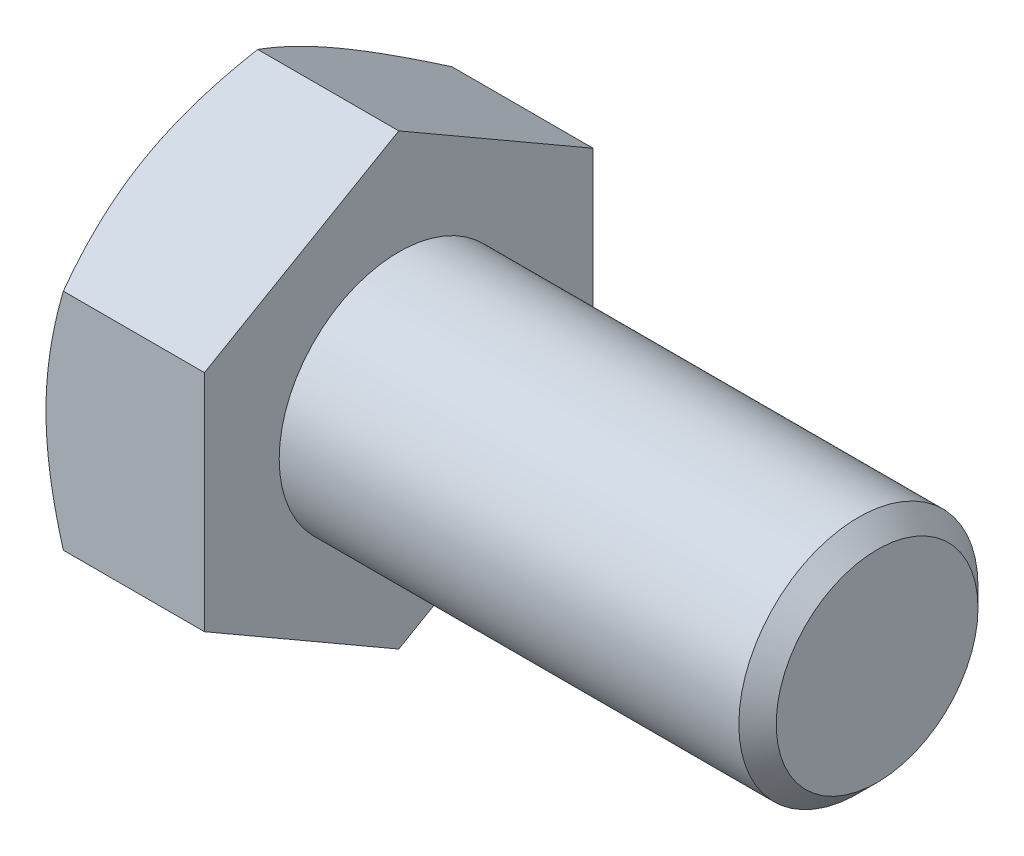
ISO-10303-21;
HEADER;
FILE_DESCRIPTION(('STEP AP214'),'2;1');
FILE_NAME('part.step','',(''),(''),'','','');
FILE_SCHEMA(('AUTOMOTIVE_DESIGN { 1 0 10303 214 1 1 1 1 }'));
ENDSEC;
DATA;
#1=APPLICATION_CONTEXT('core data for automotive mechanical design processes');
#2=APPLICATION_PROTOCOL_DEFINITION('international standard','automotive_design',2000,#1);
#3=PRODUCT_CONTEXT('',#1,'mechanical');
#4=PRODUCT('Part','Part','',(#3));
#5=PRODUCT_RELATED_PRODUCT_CATEGORY('part','',(#4));
#6=PRODUCT_DEFINITION_FORMATION('','',#4);
#7=PRODUCT_DEFINITION_CONTEXT('part definition',#1,'design');
#8=PRODUCT_DEFINITION('design','',#6,#7);
#9=PRODUCT_DEFINITION_SHAPE('','',#8);
#10=(LENGTH_UNIT() NAMED_UNIT(*) SI_UNIT(.MILLI.,.METRE.));
#11=(NAMED_UNIT(*) PLANE_ANGLE_UNIT() SI_UNIT($,.RADIAN.));
#12=(NAMED_UNIT(*) SI_UNIT($,.STERADIAN.) SOLID_ANGLE_UNIT());
#13=UNCERTAINTY_MEASURE_WITH_UNIT(LENGTH_MEASURE(1.E-05),#10,'distance_accuracy_value','');
#14=(GEOMETRIC_REPRESENTATION_CONTEXT(3) GLOBAL_UNCERTAINTY_ASSIGNED_CONTEXT((#13)) GLOBAL_UNIT_ASSIGNED_CONTEXT((#10,
#11,#12)) REPRESENTATION_CONTEXT('',''));
#15=CARTESIAN_POINT('',(0.,0.,0.));
#16=DIRECTION('',(0.,0.,1.));
#17=DIRECTION('',(1.,0.,0.));
#18=AXIS2_PLACEMENT_3D('',#15,#16,#17);
#19=CARTESIAN_POINT('',(16.,0.,0.));
#20=DIRECTION('',(-1.,0.,0.));
#21=DIRECTION('',(0.,0.,1.));
#22=AXIS2_PLACEMENT_3D('',#19,#20,#21);
#23=CYLINDRICAL_SURFACE('',#22,4.);
#24=CARTESIAN_POINT('',(15.375,0.,0.));
#25=DIRECTION('',(1.,0.,0.));
#26=DIRECTION('',(0.,0.,-1.));
#27=AXIS2_PLACEMENT_3D('',#24,#25,#26);
#28=CIRCLE('',#27,4.);
#29=CARTESIAN_POINT('',(15.375,0.,-4.));
#30=VERTEX_POINT('',#29);
#31=EDGE_CURVE('E11',#30,#30,#28,.F.);
#32=ORIENTED_EDGE('',*,*,#31,.T.);
#33=EDGE_LOOP('',(#32));
#34=FACE_BOUND('',#33,.T.);
#35=CARTESIAN_POINT('',(0.,0.,0.));
#36=DIRECTION('',(-1.,0.,0.));
#37=DIRECTION('',(0.,0.,1.));
#38=AXIS2_PLACEMENT_3D('',#35,#36,#37);
#39=CIRCLE('',#38,4.);
#40=CARTESIAN_POINT('',(0.,0.,4.));
#41=VERTEX_POINT('',#40);
#42=EDGE_CURVE('E204',#41,#41,#39,.T.);
#43=ORIENTED_EDGE('',*,*,#42,.F.);
#44=EDGE_LOOP('',(#43));
#45=FACE_BOUND('',#44,.T.);
#46=ADVANCED_FACE('F30',(#34,#45),#23,.T.);
#47=CARTESIAN_POINT('',(16.,0.,0.));
#48=DIRECTION('',(1.,0.,0.));
#49=DIRECTION('',(0.,0.,-1.));
#50=AXIS2_PLACEMENT_3D('',#47,#48,#49);
#51=PLANE('',#50);
#52=CARTESIAN_POINT('',(16.,0.,0.));
#53=DIRECTION('',(1.,0.,0.));
#54=DIRECTION('',(0.,0.,-1.));
#55=AXIS2_PLACEMENT_3D('',#52,#53,#54);
#56=CIRCLE('',#55,3.37499999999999);
#57=CARTESIAN_POINT('',(16.,0.,-3.37499999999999));
#58=VERTEX_POINT('',#57);
#59=EDGE_CURVE('E37',#58,#58,#56,.T.);
#60=ORIENTED_EDGE('',*,*,#59,.T.);
#61=EDGE_LOOP('',(#60));
#62=FACE_BOUND('',#61,.T.);
#63=ADVANCED_FACE('F190',(#62),#51,.T.);
#64=CARTESIAN_POINT('',(0.,-7.50555349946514,0.));
#65=DIRECTION('',(-1.,0.,0.));
#66=DIRECTION('',(0.,0.,1.));
#67=AXIS2_PLACEMENT_3D('',#64,#65,#66);
#68=PLANE('',#67);
#69=DIRECTION('',(0.,0.5,0.866025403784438));
#70=VECTOR('',#69,1.);
#71=CARTESIAN_POINT('',(0.,-7.50555349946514,0.));
#72=LINE('',#71,#70);
#73=CARTESIAN_POINT('',(0.,-7.50555349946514,0.));
#74=VERTEX_POINT('',#73);
#75=CARTESIAN_POINT('',(0.,-3.75277674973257,6.5));
#76=VERTEX_POINT('',#75);
#77=EDGE_CURVE('E231',#74,#76,#72,.T.);
#78=ORIENTED_EDGE('',*,*,#77,.F.);
#79=DIRECTION('',(0.,0.5,-0.866025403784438));
#80=VECTOR('',#79,1.);
#81=CARTESIAN_POINT('',(0.,-7.50555349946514,0.));
#82=LINE('',#81,#80);
#83=CARTESIAN_POINT('',(0.,-3.75277674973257,-6.5));
#84=VERTEX_POINT('',#83);
#85=EDGE_CURVE('E218',#74,#84,#82,.T.);
#86=ORIENTED_EDGE('',*,*,#85,.T.);
#87=DIRECTION('',(0.,1.,0.));
#88=VECTOR('',#87,1.);
#89=CARTESIAN_POINT('',(0.,-3.75277674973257,-6.5));
#90=LINE('',#89,#88);
#91=CARTESIAN_POINT('',(0.,3.75277674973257,-6.5));
#92=VERTEX_POINT('',#91);
#93=EDGE_CURVE('E221',#84,#92,#90,.T.);
#94=ORIENTED_EDGE('',*,*,#93,.T.);
#95=DIRECTION('',(0.,0.5,0.866025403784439));
#96=VECTOR('',#95,1.);
#97=CARTESIAN_POINT('',(0.,3.75277674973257,-6.5));
#98=LINE('',#97,#96);
#99=CARTESIAN_POINT('',(0.,7.50555349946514,0.));
#100=VERTEX_POINT('',#99);
#101=EDGE_CURVE('E224',#92,#100,#98,.T.);
#102=ORIENTED_EDGE('',*,*,#101,.T.);
#103=DIRECTION('',(0.,0.5,-0.866025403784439));
#104=VECTOR('',#103,1.);
#105=CARTESIAN_POINT('',(0.,3.75277674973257,6.5));
#106=LINE('',#105,#104);
#107=CARTESIAN_POINT('',(0.,3.75277674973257,6.5));
#108=VERTEX_POINT('',#107);
#109=EDGE_CURVE('E227',#108,#100,#106,.T.);
#110=ORIENTED_EDGE('',*,*,#109,.F.);
#111=DIRECTION('',(0.,1.,0.));
#112=VECTOR('',#111,1.);
#113=CARTESIAN_POINT('',(0.,-3.75277674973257,6.5));
#114=LINE('',#113,#112);
#115=EDGE_CURVE('E229',#76,#108,#114,.T.);
#116=ORIENTED_EDGE('',*,*,#115,.F.);
#117=EDGE_LOOP('',(#78,#86,#94,#102,#110,#116));
#118=FACE_BOUND('',#117,.T.);
#119=ORIENTED_EDGE('',*,*,#42,.T.);
#120=EDGE_LOOP('',(#119));
#121=FACE_BOUND('',#120,.T.);
#122=ADVANCED_FACE('F161',(#118,#121),#68,.F.);
#123=CARTESIAN_POINT('',(-5.3,-7.50555349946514,0.));
#124=DIRECTION('',(0.,0.866025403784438,-0.5));
#125=DIRECTION('',(0.,0.5,0.866025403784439));
#126=AXIS2_PLACEMENT_3D('',#123,#124,#125);
#127=PLANE('',#126);
#128=CARTESIAN_POINT('',(-4.71937674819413,-7.50566896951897,-0.000200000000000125));
#129=CARTESIAN_POINT('',(-4.76699557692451,-7.4231786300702,0.142677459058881));
#130=CARTESIAN_POINT('',(-4.81245329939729,-7.34038072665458,0.286087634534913));
#131=CARTESIAN_POINT('',(-4.89845131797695,-7.17411251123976,0.574072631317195));
#132=CARTESIAN_POINT('',(-4.93898949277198,-7.09064192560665,0.718647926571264));
#133=CARTESIAN_POINT('',(-5.05242899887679,-6.83889369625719,1.15468865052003));
#134=CARTESIAN_POINT('',(-5.11695219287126,-6.66962231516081,1.44787528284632));
#135=CARTESIAN_POINT('',(-5.19261341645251,-6.41631077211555,1.88662374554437));
#136=CARTESIAN_POINT('',(-5.21416714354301,-6.33302748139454,2.03087463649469));
#137=CARTESIAN_POINT('',(-5.25030968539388,-6.16608458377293,2.32002821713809));
#138=CARTESIAN_POINT('',(-5.26489911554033,-6.08242501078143,2.46493084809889));
#139=CARTESIAN_POINT('',(-5.28674124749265,-5.91496056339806,2.75498777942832));
#140=CARTESIAN_POINT('',(-5.29400227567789,-5.8311559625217,2.90014160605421));
#141=CARTESIAN_POINT('',(-5.30103969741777,-5.66347396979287,3.19057533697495));
#142=CARTESIAN_POINT('',(-5.3008163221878,-5.5795965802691,3.33585523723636));
#143=CARTESIAN_POINT('',(-5.28991654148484,-5.34979921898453,3.73387594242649));
#144=CARTESIAN_POINT('',(-5.27161818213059,-5.20395446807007,3.98648646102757));
#145=CARTESIAN_POINT('',(-5.21359365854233,-4.91323365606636,4.49002967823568));
#146=CARTESIAN_POINT('',(-5.17384766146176,-4.76835861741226,4.74096060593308));
#147=CARTESIAN_POINT('',(-5.07449409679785,-4.47705272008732,5.24551722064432));
#148=CARTESIAN_POINT('',(-5.01446557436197,-4.33065861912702,5.49907924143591));
#149=CARTESIAN_POINT('',(-4.87822500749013,-4.04005357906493,6.00242193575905));
#150=CARTESIAN_POINT('',(-4.80204496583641,-3.89583891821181,6.25220905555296));
#151=CARTESIAN_POINT('',(-4.71937674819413,-3.75266127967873,6.5002));
#152=B_SPLINE_CURVE_WITH_KNOTS('',3,(#128,#129,#130,#131,#132,#133,#134,#135,#136,#137,#138,
#139,#140,#141,#142,#143,#144,#145,#146,#147,#148,#149,#150,#151),.UNSPECIFIED.,.F.,.F.,(4,2,2,
2,2,2,2,2,2,2,2,4),(0.,0.515105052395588,1.03043143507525,2.06322554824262,2.56697389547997,
3.07067772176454,3.57380860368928,4.0769239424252,4.9527935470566,5.82947446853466,
6.72559912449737,7.61996451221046),.UNSPECIFIED.);
#153=CARTESIAN_POINT('',(-4.71944341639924,-7.50555349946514,0.));
#154=VERTEX_POINT('',#153);
#155=CARTESIAN_POINT('',(-5.3,-5.62916512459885,3.25));
#156=VERTEX_POINT('',#155);
#157=EDGE_CURVE('E178',#154,#156,#152,.T.);
#158=ORIENTED_EDGE('',*,*,#157,.F.);
#159=DIRECTION('',(1.,0.,0.));
#160=VECTOR('',#159,1.);
#161=CARTESIAN_POINT('',(-5.3,-7.50555349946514,0.));
#162=LINE('',#161,#160);
#163=EDGE_CURVE('E216',#154,#74,#162,.T.);
#164=ORIENTED_EDGE('',*,*,#163,.T.);
#165=ORIENTED_EDGE('',*,*,#77,.T.);
#166=DIRECTION('',(1.,0.,0.));
#167=VECTOR('',#166,1.);
#168=CARTESIAN_POINT('',(-5.3,-3.75277674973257,6.5));
#169=LINE('',#168,#167);
#170=CARTESIAN_POINT('',(-4.71944341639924,-3.75277674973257,6.5));
#171=VERTEX_POINT('',#170);
#172=EDGE_CURVE('E207',#171,#76,#169,.T.);
#173=ORIENTED_EDGE('',*,*,#172,.F.);
#174=EDGE_CURVE('E132',#156,#171,#152,.T.);
#175=ORIENTED_EDGE('',*,*,#174,.F.);
#176=EDGE_LOOP('',(#158,#164,#165,#173,#175));
#177=FACE_BOUND('',#176,.T.);
#178=ADVANCED_FACE('F184',(#177),#127,.F.);
#179=CARTESIAN_POINT('',(-5.3,-3.75277674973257,6.5));
#180=DIRECTION('',(0.,0.,-1.));
#181=DIRECTION('',(-1.,0.,0.));
#182=AXIS2_PLACEMENT_3D('',#179,#180,#181);
#183=PLANE('',#182);
#184=CARTESIAN_POINT('',(-2.0488375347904,-10.2428264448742,6.5));
#185=CARTESIAN_POINT('',(-2.18789595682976,-9.95749123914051,6.5));
#186=CARTESIAN_POINT('',(-2.32566707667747,-9.67151814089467,6.5));
#187=CARTESIAN_POINT('',(-2.59791370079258,-9.09795746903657,6.5));
#188=CARTESIAN_POINT('',(-2.73238871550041,-8.81036966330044,6.5));
#189=CARTESIAN_POINT('',(-2.99796413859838,-8.23183597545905,6.5));
#190=CARTESIAN_POINT('',(-3.12904355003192,-7.94088042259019,6.5));
#191=CARTESIAN_POINT('',(-3.38604980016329,-7.35671087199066,6.5));
#192=CARTESIAN_POINT('',(-3.51197687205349,-7.06349697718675,6.5));
#193=CARTESIAN_POINT('',(-3.76148583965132,-6.4643492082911,6.5));
#194=CARTESIAN_POINT('',(-3.88484316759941,-6.15832132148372,6.5));
#195=CARTESIAN_POINT('',(-4.122608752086,-5.54274557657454,6.5));
#196=CARTESIAN_POINT('',(-4.23701602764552,-5.23319733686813,6.5));
#197=CARTESIAN_POINT('',(-4.45399730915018,-4.61061796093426,6.5));
#198=CARTESIAN_POINT('',(-4.55659391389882,-4.29759477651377,6.5));
#199=CARTESIAN_POINT('',(-4.7467687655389,-3.66705774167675,6.5));
#200=CARTESIAN_POINT('',(-4.83435157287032,-3.34954528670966,6.5));
#201=CARTESIAN_POINT('',(-4.98994277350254,-2.7116231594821,6.5));
#202=CARTESIAN_POINT('',(-5.05806094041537,-2.39124068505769,6.5));
#203=CARTESIAN_POINT('',(-5.17096432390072,-1.74628166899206,6.5));
#204=CARTESIAN_POINT('',(-5.21575208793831,-1.42170558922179,6.5));
#205=CARTESIAN_POINT('',(-5.26247031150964,-0.935153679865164,6.5));
#206=CARTESIAN_POINT('',(-5.27461755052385,-0.774120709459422,6.5));
#207=CARTESIAN_POINT('',(-5.29209027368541,-0.451677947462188,6.5));
#208=CARTESIAN_POINT('',(-5.29741587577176,-0.290268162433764,6.5));
#209=CARTESIAN_POINT('',(-5.30111032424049,0.0326315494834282,6.5));
#210=CARTESIAN_POINT('',(-5.29947913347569,0.194121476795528,6.5));
#211=CARTESIAN_POINT('',(-5.28930353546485,0.516885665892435,6.5));
#212=CARTESIAN_POINT('',(-5.2807588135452,0.678159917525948,6.5));
#213=CARTESIAN_POINT('',(-5.2524625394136,1.06087214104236,6.5));
#214=CARTESIAN_POINT('',(-5.22970222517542,1.28209274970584,6.5));
#215=CARTESIAN_POINT('',(-5.17237790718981,1.72298724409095,6.5));
#216=CARTESIAN_POINT('',(-5.13781243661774,1.94266093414,6.5));
#217=CARTESIAN_POINT('',(-5.01823337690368,2.59905068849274,6.5));
#218=CARTESIAN_POINT('',(-4.91735524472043,3.03292018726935,6.5));
#219=CARTESIAN_POINT('',(-4.74117763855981,3.68203059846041,6.5));
#220=CARTESIAN_POINT('',(-4.67743243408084,3.90060192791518,6.5));
#221=CARTESIAN_POINT('',(-4.54301317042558,4.33562456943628,6.5));
#222=CARTESIAN_POINT('',(-4.47233905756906,4.55207586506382,6.5));
#223=CARTESIAN_POINT('',(-4.32522134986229,4.9829231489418,6.5));
#224=CARTESIAN_POINT('',(-4.24877936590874,5.19731969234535,6.5));
#225=CARTESIAN_POINT('',(-4.09105605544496,5.62431367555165,6.5));
#226=CARTESIAN_POINT('',(-4.00977484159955,5.83691115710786,6.5));
#227=CARTESIAN_POINT('',(-3.78396124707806,6.41107024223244,6.5));
#228=CARTESIAN_POINT('',(-3.63553740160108,6.7710999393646,6.5));
#229=CARTESIAN_POINT('',(-3.3299136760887,7.4874289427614,6.5));
#230=CARTESIAN_POINT('',(-3.17271280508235,7.84372782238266,6.5));
#231=CARTESIAN_POINT('',(-2.8516207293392,8.55345570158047,6.5));
#232=CARTESIAN_POINT('',(-2.68772693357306,8.90688352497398,6.5));
#233=CARTESIAN_POINT('',(-2.35485675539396,9.61131133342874,6.5));
#234=CARTESIAN_POINT('',(-2.18588058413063,9.96231141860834,6.5));
#235=CARTESIAN_POINT('',(-1.84367823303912,10.662937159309,6.5));
#236=CARTESIAN_POINT('',(-1.67044558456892,11.012559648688,6.5));
#237=CARTESIAN_POINT('',(-1.32082260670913,11.7102232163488,6.5));
#238=CARTESIAN_POINT('',(-1.14443225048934,12.0582642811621,6.5));
#239=CARTESIAN_POINT('',(-0.78915631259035,12.7529700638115,6.5));
#240=CARTESIAN_POINT('',(-0.610271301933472,13.099635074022,6.5));
#241=CARTESIAN_POINT('',(-0.250435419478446,13.7918918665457,6.5));
#242=CARTESIAN_POINT('',(-0.0694845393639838,14.1374836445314,6.5));
#243=CARTESIAN_POINT('',(0.437179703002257,15.099399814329,6.5));
#244=CARTESIAN_POINT('',(0.7647482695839,15.7147468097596,6.5));
#245=CARTESIAN_POINT('',(1.4238123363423,16.9433793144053,6.5));
#246=CARTESIAN_POINT('',(1.75530808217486,17.5566646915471,6.5));
#247=CARTESIAN_POINT('',(2.42008717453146,18.779571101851,6.5));
#248=CARTESIAN_POINT('',(2.75336064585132,19.3891975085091,6.5));
#249=CARTESIAN_POINT('',(3.4221398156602,20.6071616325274,6.5));
#250=CARTESIAN_POINT('',(3.75764533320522,21.2154994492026,6.5));
#251=CARTESIAN_POINT('',(4.0939612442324,21.8233856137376,6.5));
#252=B_SPLINE_CURVE_WITH_KNOTS('',3,(#184,#185,#186,#187,#188,#189,#190,#191,#192,#193,#194,
#195,#196,#197,#198,#199,#200,#201,#202,#203,#204,#205,#206,#207,#208,#209,#210,#211,#212,#213,
#214,#215,#216,#217,#218,#219,#220,#221,#222,#223,#224,#225,#226,#227,#228,#229,#230,#231,#232,
#233,#234,#235,#236,#237,#238,#239,#240,#241,#242,#243,#244,#245,#246,#247,#248,#249,#250,#251),
.UNSPECIFIED.,.F.,.F.,(4,2,2,2,2,2,2,2,2,2,2,2,2,2,2,2,2,2,2,2,2,2,2,2,2,2,2,2,2,2,2,2,2,4),(0.,
0.952261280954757,1.90466315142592,2.86198011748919,3.81925370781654,4.80900961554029,
5.79887385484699,6.78681142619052,7.77444837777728,8.75640022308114,9.73824482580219,
10.2225937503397,10.7069343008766,11.1912774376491,11.6756426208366,12.3424346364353,
13.0093095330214,14.3437044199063,15.0266742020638,15.7096492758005,16.3924343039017,
17.0752034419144,18.2433007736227,19.4115302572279,20.580216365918,21.7488539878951,
22.9193933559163,24.0899426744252,25.2602283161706,26.4305186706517,28.5218066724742,
30.6132261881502,32.6975528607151,34.7817125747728),.UNSPECIFIED.);
#253=CARTESIAN_POINT('',(-5.3,0.,6.5));
#254=VERTEX_POINT('',#253);
#255=EDGE_CURVE('E233',#171,#254,#252,.T.);
#256=ORIENTED_EDGE('',*,*,#255,.F.);
#257=ORIENTED_EDGE('',*,*,#172,.T.);
#258=ORIENTED_EDGE('',*,*,#115,.T.);
#259=DIRECTION('',(1.,0.,0.));
#260=VECTOR('',#259,1.);
#261=CARTESIAN_POINT('',(-5.3,3.75277674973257,6.5));
#262=LINE('',#261,#260);
#263=CARTESIAN_POINT('',(-4.71944341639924,3.75277674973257,6.5));
#264=VERTEX_POINT('',#263);
#265=EDGE_CURVE('E209',#264,#108,#262,.T.);
#266=ORIENTED_EDGE('',*,*,#265,.F.);
#267=EDGE_CURVE('E103',#254,#264,#252,.T.);
#268=ORIENTED_EDGE('',*,*,#267,.F.);
#269=EDGE_LOOP('',(#256,#257,#258,#266,#268));
#270=FACE_BOUND('',#269,.T.);
#271=ADVANCED_FACE('F187',(#270),#183,.F.);
#272=CARTESIAN_POINT('',(-5.3,3.75277674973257,6.5));
#273=DIRECTION('',(0.,-0.866025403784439,-0.5));
#274=DIRECTION('',(0.,0.5,-0.866025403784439));
#275=AXIS2_PLACEMENT_3D('',#272,#273,#274);
#276=PLANE('',#275);
#277=CARTESIAN_POINT('',(-4.71937674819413,3.75266127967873,6.5002));
#278=CARTESIAN_POINT('',(-4.76699557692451,3.83515161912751,6.35732254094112));
#279=CARTESIAN_POINT('',(-4.81245329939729,3.91794952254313,6.21391236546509));
#280=CARTESIAN_POINT('',(-4.89845131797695,4.08421773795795,5.9259273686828));
#281=CARTESIAN_POINT('',(-4.93898949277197,4.16768832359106,5.78135207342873));
#282=CARTESIAN_POINT('',(-5.05242899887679,4.41943655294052,5.34531134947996));
#283=CARTESIAN_POINT('',(-5.11695219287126,4.5887079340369,5.05212471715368));
#284=CARTESIAN_POINT('',(-5.19261341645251,4.84201947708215,4.61337625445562));
#285=CARTESIAN_POINT('',(-5.21416714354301,4.92530276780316,4.46912536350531));
#286=CARTESIAN_POINT('',(-5.25030968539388,5.09224566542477,4.17997178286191));
#287=CARTESIAN_POINT('',(-5.26489911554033,5.17590523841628,4.03506915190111));
#288=CARTESIAN_POINT('',(-5.28674124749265,5.34336968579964,3.74501222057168));
#289=CARTESIAN_POINT('',(-5.29400227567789,5.427174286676,3.59985839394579));
#290=CARTESIAN_POINT('',(-5.30103969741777,5.59485627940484,3.30942466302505));
#291=CARTESIAN_POINT('',(-5.30081632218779,5.6787336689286,3.16414476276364));
#292=CARTESIAN_POINT('',(-5.28991654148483,5.90853103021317,2.7661240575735));
#293=CARTESIAN_POINT('',(-5.27161818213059,6.05437578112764,2.51351353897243));
#294=CARTESIAN_POINT('',(-5.21359365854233,6.34509659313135,2.00997032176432));
#295=CARTESIAN_POINT('',(-5.17384766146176,6.48997163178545,1.75903939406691));
#296=CARTESIAN_POINT('',(-5.07449409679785,6.78127752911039,1.25448277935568));
#297=CARTESIAN_POINT('',(-5.01446557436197,6.92767163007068,1.00092075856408));
#298=CARTESIAN_POINT('',(-4.87822500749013,7.21827667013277,0.497578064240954));
#299=CARTESIAN_POINT('',(-4.80204496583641,7.36249133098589,0.247790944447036));
#300=CARTESIAN_POINT('',(-4.71937674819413,7.50566896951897,-0.000199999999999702));
#301=B_SPLINE_CURVE_WITH_KNOTS('',3,(#277,#278,#279,#280,#281,#282,#283,#284,#285,#286,#287,
#288,#289,#290,#291,#292,#293,#294,#295,#296,#297,#298,#299,#300),.UNSPECIFIED.,.F.,.F.,(4,2,2,
2,2,2,2,2,2,2,2,4),(0.,0.515105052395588,1.03043143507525,2.06322554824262,2.56697389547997,
3.07067772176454,3.57380860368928,4.0769239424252,4.9527935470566,5.82947446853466,
6.72559912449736,7.61996451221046),.UNSPECIFIED.);
#302=CARTESIAN_POINT('',(-5.3,5.62916512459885,3.25));
#303=VERTEX_POINT('',#302);
#304=EDGE_CURVE('E99',#264,#303,#301,.T.);
#305=ORIENTED_EDGE('',*,*,#304,.F.);
#306=ORIENTED_EDGE('',*,*,#265,.T.);
#307=ORIENTED_EDGE('',*,*,#109,.T.);
#308=DIRECTION('',(1.,0.,0.));
#309=VECTOR('',#308,1.);
#310=CARTESIAN_POINT('',(-5.3,7.50555349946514,0.));
#311=LINE('',#310,#309);
#312=CARTESIAN_POINT('',(-4.71944341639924,7.50555349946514,0.));
#313=VERTEX_POINT('',#312);
#314=EDGE_CURVE('E131',#313,#100,#311,.T.);
#315=ORIENTED_EDGE('',*,*,#314,.F.);
#316=EDGE_CURVE('E107',#303,#313,#301,.T.);
#317=ORIENTED_EDGE('',*,*,#316,.F.);
#318=EDGE_LOOP('',(#305,#306,#307,#315,#317));
#319=FACE_BOUND('',#318,.T.);
#320=ADVANCED_FACE('F129',(#319),#276,.F.);
#321=CARTESIAN_POINT('',(-5.3,3.75277674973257,-6.5));
#322=DIRECTION('',(0.,0.866025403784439,-0.5));
#323=DIRECTION('',(0.,0.5,0.866025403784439));
#324=AXIS2_PLACEMENT_3D('',#321,#322,#323);
#325=PLANE('',#324);
#326=DIRECTION('',(1.,0.,0.));
#327=VECTOR('',#326,1.);
#328=CARTESIAN_POINT('',(-5.3,3.75277674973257,-6.5));
#329=LINE('',#328,#327);
#330=CARTESIAN_POINT('',(-4.71944341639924,3.75277674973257,-6.5));
#331=VERTEX_POINT('',#330);
#332=EDGE_CURVE('E212',#331,#92,#329,.T.);
#333=ORIENTED_EDGE('',*,*,#332,.F.);
#334=CARTESIAN_POINT('',(-4.71937674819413,3.75266127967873,-6.5002));
#335=CARTESIAN_POINT('',(-4.76699557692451,3.83515161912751,-6.35732254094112));
#336=CARTESIAN_POINT('',(-4.81245329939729,3.91794952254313,-6.21391236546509));
#337=CARTESIAN_POINT('',(-4.89845131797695,4.08421773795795,-5.9259273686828));
#338=CARTESIAN_POINT('',(-4.93898949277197,4.16768832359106,-5.78135207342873));
#339=CARTESIAN_POINT('',(-5.05242899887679,4.41943655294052,-5.34531134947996));
#340=CARTESIAN_POINT('',(-5.11695219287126,4.5887079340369,-5.05212471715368));
#341=CARTESIAN_POINT('',(-5.19261341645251,4.84201947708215,-4.61337625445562));
#342=CARTESIAN_POINT('',(-5.21416714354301,4.92530276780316,-4.46912536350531));
#343=CARTESIAN_POINT('',(-5.25030968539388,5.09224566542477,-4.17997178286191));
#344=CARTESIAN_POINT('',(-5.26489911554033,5.17590523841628,-4.03506915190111));
#345=CARTESIAN_POINT('',(-5.28674124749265,5.34336968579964,-3.74501222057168));
#346=CARTESIAN_POINT('',(-5.29400227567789,5.427174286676,-3.59985839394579));
#347=CARTESIAN_POINT('',(-5.30103969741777,5.59485627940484,-3.30942466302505));
#348=CARTESIAN_POINT('',(-5.30081632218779,5.6787336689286,-3.16414476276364));
#349=CARTESIAN_POINT('',(-5.28991654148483,5.90853103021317,-2.7661240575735));
#350=CARTESIAN_POINT('',(-5.27161818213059,6.05437578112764,-2.51351353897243));
#351=CARTESIAN_POINT('',(-5.21359365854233,6.34509659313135,-2.00997032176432));
#352=CARTESIAN_POINT('',(-5.17384766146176,6.48997163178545,-1.75903939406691));
#353=CARTESIAN_POINT('',(-5.07449409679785,6.78127752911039,-1.25448277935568));
#354=CARTESIAN_POINT('',(-5.01446557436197,6.92767163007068,-1.00092075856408));
#355=CARTESIAN_POINT('',(-4.87822500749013,7.21827667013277,-0.497578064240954));
#356=CARTESIAN_POINT('',(-4.80204496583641,7.36249133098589,-0.247790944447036));
#357=CARTESIAN_POINT('',(-4.71937674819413,7.50566896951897,0.000199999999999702));
#358=B_SPLINE_CURVE_WITH_KNOTS('',3,(#334,#335,#336,#337,#338,#339,#340,#341,#342,#343,#344,
#345,#346,#347,#348,#349,#350,#351,#352,#353,#354,#355,#356,#357),.UNSPECIFIED.,.F.,.F.,(4,2,2,
2,2,2,2,2,2,2,2,4),(0.,0.515105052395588,1.03043143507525,2.06322554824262,2.56697389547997,
3.07067772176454,3.57380860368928,4.0769239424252,4.9527935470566,5.82947446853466,
6.72559912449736,7.61996451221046),.UNSPECIFIED.);
#359=CARTESIAN_POINT('',(-5.3,5.62916512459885,-3.25));
#360=VERTEX_POINT('',#359);
#361=EDGE_CURVE('E134',#331,#360,#358,.T.);
#362=ORIENTED_EDGE('',*,*,#361,.T.);
#363=EDGE_CURVE('E114',#360,#313,#358,.T.);
#364=ORIENTED_EDGE('',*,*,#363,.T.);
#365=ORIENTED_EDGE('',*,*,#314,.T.);
#366=ORIENTED_EDGE('',*,*,#101,.F.);
#367=EDGE_LOOP('',(#333,#362,#364,#365,#366));
#368=FACE_BOUND('',#367,.T.);
#369=ADVANCED_FACE('F259',(#368),#325,.T.);
#370=CARTESIAN_POINT('',(-5.3,-3.75277674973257,-6.5));
#371=DIRECTION('',(0.,0.,-1.));
#372=DIRECTION('',(-1.,0.,0.));
#373=AXIS2_PLACEMENT_3D('',#370,#371,#372);
#374=PLANE('',#373);
#375=DIRECTION('',(1.,0.,0.));
#376=VECTOR('',#375,1.);
#377=CARTESIAN_POINT('',(-5.3,-3.75277674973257,-6.5));
#378=LINE('',#377,#376);
#379=CARTESIAN_POINT('',(-4.71944341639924,-3.75277674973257,-6.5));
#380=VERTEX_POINT('',#379);
#381=EDGE_CURVE('E214',#380,#84,#378,.T.);
#382=ORIENTED_EDGE('',*,*,#381,.F.);
#383=CARTESIAN_POINT('',(-2.0488375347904,-10.2428264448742,-6.5));
#384=CARTESIAN_POINT('',(-2.18789595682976,-9.95749123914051,-6.5));
#385=CARTESIAN_POINT('',(-2.32566707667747,-9.67151814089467,-6.5));
#386=CARTESIAN_POINT('',(-2.59791370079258,-9.09795746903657,-6.5));
#387=CARTESIAN_POINT('',(-2.73238871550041,-8.81036966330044,-6.5));
#388=CARTESIAN_POINT('',(-2.99796413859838,-8.23183597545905,-6.5));
#389=CARTESIAN_POINT('',(-3.12904355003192,-7.94088042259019,-6.5));
#390=CARTESIAN_POINT('',(-3.38604980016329,-7.35671087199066,-6.5));
#391=CARTESIAN_POINT('',(-3.51197687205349,-7.06349697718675,-6.5));
#392=CARTESIAN_POINT('',(-3.76148583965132,-6.4643492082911,-6.5));
#393=CARTESIAN_POINT('',(-3.88484316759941,-6.15832132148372,-6.5));
#394=CARTESIAN_POINT('',(-4.122608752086,-5.54274557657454,-6.5));
#395=CARTESIAN_POINT('',(-4.23701602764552,-5.23319733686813,-6.5));
#396=CARTESIAN_POINT('',(-4.45399730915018,-4.61061796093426,-6.5));
#397=CARTESIAN_POINT('',(-4.55659391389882,-4.29759477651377,-6.5));
#398=CARTESIAN_POINT('',(-4.7467687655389,-3.66705774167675,-6.5));
#399=CARTESIAN_POINT('',(-4.83435157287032,-3.34954528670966,-6.5));
#400=CARTESIAN_POINT('',(-4.98994277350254,-2.7116231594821,-6.5));
#401=CARTESIAN_POINT('',(-5.05806094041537,-2.39124068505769,-6.5));
#402=CARTESIAN_POINT('',(-5.17096432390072,-1.74628166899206,-6.5));
#403=CARTESIAN_POINT('',(-5.21575208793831,-1.42170558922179,-6.5));
#404=CARTESIAN_POINT('',(-5.26247031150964,-0.935153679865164,-6.5));
#405=CARTESIAN_POINT('',(-5.27461755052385,-0.774120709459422,-6.5));
#406=CARTESIAN_POINT('',(-5.29209027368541,-0.451677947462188,-6.5));
#407=CARTESIAN_POINT('',(-5.29741587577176,-0.290268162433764,-6.5));
#408=CARTESIAN_POINT('',(-5.30111032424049,0.0326315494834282,-6.5));
#409=CARTESIAN_POINT('',(-5.29947913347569,0.194121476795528,-6.5));
#410=CARTESIAN_POINT('',(-5.28930353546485,0.516885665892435,-6.5));
#411=CARTESIAN_POINT('',(-5.2807588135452,0.678159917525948,-6.5));
#412=CARTESIAN_POINT('',(-5.2524625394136,1.06087214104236,-6.5));
#413=CARTESIAN_POINT('',(-5.22970222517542,1.28209274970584,-6.5));
#414=CARTESIAN_POINT('',(-5.17237790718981,1.72298724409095,-6.5));
#415=CARTESIAN_POINT('',(-5.13781243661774,1.94266093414,-6.5));
#416=CARTESIAN_POINT('',(-5.01823337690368,2.59905068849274,-6.5));
#417=CARTESIAN_POINT('',(-4.91735524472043,3.03292018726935,-6.5));
#418=CARTESIAN_POINT('',(-4.74117763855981,3.68203059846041,-6.5));
#419=CARTESIAN_POINT('',(-4.67743243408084,3.90060192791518,-6.5));
#420=CARTESIAN_POINT('',(-4.54301317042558,4.33562456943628,-6.5));
#421=CARTESIAN_POINT('',(-4.47233905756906,4.55207586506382,-6.5));
#422=CARTESIAN_POINT('',(-4.32522134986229,4.9829231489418,-6.5));
#423=CARTESIAN_POINT('',(-4.24877936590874,5.19731969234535,-6.5));
#424=CARTESIAN_POINT('',(-4.09105605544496,5.62431367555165,-6.5));
#425=CARTESIAN_POINT('',(-4.00977484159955,5.83691115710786,-6.5));
#426=CARTESIAN_POINT('',(-3.78396124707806,6.41107024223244,-6.5));
#427=CARTESIAN_POINT('',(-3.63553740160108,6.7710999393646,-6.5));
#428=CARTESIAN_POINT('',(-3.3299136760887,7.4874289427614,-6.5));
#429=CARTESIAN_POINT('',(-3.17271280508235,7.84372782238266,-6.5));
#430=CARTESIAN_POINT('',(-2.8516207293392,8.55345570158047,-6.5));
#431=CARTESIAN_POINT('',(-2.68772693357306,8.90688352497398,-6.5));
#432=CARTESIAN_POINT('',(-2.35485675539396,9.61131133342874,-6.5));
#433=CARTESIAN_POINT('',(-2.18588058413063,9.96231141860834,-6.5));
#434=CARTESIAN_POINT('',(-1.84367823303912,10.662937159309,-6.5));
#435=CARTESIAN_POINT('',(-1.67044558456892,11.012559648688,-6.5));
#436=CARTESIAN_POINT('',(-1.32082260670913,11.7102232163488,-6.5));
#437=CARTESIAN_POINT('',(-1.14443225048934,12.0582642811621,-6.5));
#438=CARTESIAN_POINT('',(-0.78915631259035,12.7529700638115,-6.5));
#439=CARTESIAN_POINT('',(-0.610271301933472,13.099635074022,-6.5));
#440=CARTESIAN_POINT('',(-0.250435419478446,13.7918918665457,-6.5));
#441=CARTESIAN_POINT('',(-0.0694845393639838,14.1374836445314,-6.5));
#442=CARTESIAN_POINT('',(0.437179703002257,15.099399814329,-6.5));
#443=CARTESIAN_POINT('',(0.7647482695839,15.7147468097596,-6.5));
#444=CARTESIAN_POINT('',(1.4238123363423,16.9433793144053,-6.5));
#445=CARTESIAN_POINT('',(1.75530808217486,17.5566646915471,-6.5));
#446=CARTESIAN_POINT('',(2.42008717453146,18.779571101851,-6.5));
#447=CARTESIAN_POINT('',(2.75336064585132,19.3891975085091,-6.5));
#448=CARTESIAN_POINT('',(3.4221398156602,20.6071616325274,-6.5));
#449=CARTESIAN_POINT('',(3.75764533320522,21.2154994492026,-6.5));
#450=CARTESIAN_POINT('',(4.0939612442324,21.8233856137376,-6.5));
#451=B_SPLINE_CURVE_WITH_KNOTS('',3,(#383,#384,#385,#386,#387,#388,#389,#390,#391,#392,#393,
#394,#395,#396,#397,#398,#399,#400,#401,#402,#403,#404,#405,#406,#407,#408,#409,#410,#411,#412,
#413,#414,#415,#416,#417,#418,#419,#420,#421,#422,#423,#424,#425,#426,#427,#428,#429,#430,#431,
#432,#433,#434,#435,#436,#437,#438,#439,#440,#441,#442,#443,#444,#445,#446,#447,#448,#449,#450),
.UNSPECIFIED.,.F.,.F.,(4,2,2,2,2,2,2,2,2,2,2,2,2,2,2,2,2,2,2,2,2,2,2,2,2,2,2,2,2,2,2,2,2,4),(0.,
0.952261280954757,1.90466315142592,2.86198011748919,3.81925370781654,4.80900961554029,
5.79887385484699,6.78681142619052,7.77444837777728,8.75640022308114,9.73824482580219,
10.2225937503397,10.7069343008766,11.1912774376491,11.6756426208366,12.3424346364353,
13.0093095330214,14.3437044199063,15.0266742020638,15.7096492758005,16.3924343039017,
17.0752034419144,18.2433007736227,19.4115302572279,20.580216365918,21.7488539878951,
22.9193933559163,24.0899426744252,25.2602283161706,26.4305186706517,28.5218066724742,
30.6132261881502,32.6975528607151,34.7817125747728),.UNSPECIFIED.);
#452=CARTESIAN_POINT('',(-5.3,0.,-6.5));
#453=VERTEX_POINT('',#452);
#454=EDGE_CURVE('E52',#380,#453,#451,.T.);
#455=ORIENTED_EDGE('',*,*,#454,.T.);
#456=EDGE_CURVE('E183',#453,#331,#451,.T.);
#457=ORIENTED_EDGE('',*,*,#456,.T.);
#458=ORIENTED_EDGE('',*,*,#332,.T.);
#459=ORIENTED_EDGE('',*,*,#93,.F.);
#460=EDGE_LOOP('',(#382,#455,#457,#458,#459));
#461=FACE_BOUND('',#460,.T.);
#462=ADVANCED_FACE('F255',(#461),#374,.T.);
#463=CARTESIAN_POINT('',(-5.3,-7.50555349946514,0.));
#464=DIRECTION('',(0.,-0.866025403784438,-0.5));
#465=DIRECTION('',(0.,0.5,-0.866025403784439));
#466=AXIS2_PLACEMENT_3D('',#463,#464,#465);
#467=PLANE('',#466);
#468=ORIENTED_EDGE('',*,*,#163,.F.);
#469=CARTESIAN_POINT('',(-4.71937674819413,-7.50566896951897,0.000200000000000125));
#470=CARTESIAN_POINT('',(-4.76699557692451,-7.4231786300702,-0.142677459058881));
#471=CARTESIAN_POINT('',(-4.81245329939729,-7.34038072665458,-0.286087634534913));
#472=CARTESIAN_POINT('',(-4.89845131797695,-7.17411251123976,-0.574072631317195));
#473=CARTESIAN_POINT('',(-4.93898949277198,-7.09064192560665,-0.718647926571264));
#474=CARTESIAN_POINT('',(-5.05242899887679,-6.83889369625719,-1.15468865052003));
#475=CARTESIAN_POINT('',(-5.11695219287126,-6.66962231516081,-1.44787528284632));
#476=CARTESIAN_POINT('',(-5.19261341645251,-6.41631077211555,-1.88662374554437));
#477=CARTESIAN_POINT('',(-5.21416714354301,-6.33302748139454,-2.03087463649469));
#478=CARTESIAN_POINT('',(-5.25030968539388,-6.16608458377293,-2.32002821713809));
#479=CARTESIAN_POINT('',(-5.26489911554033,-6.08242501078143,-2.46493084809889));
#480=CARTESIAN_POINT('',(-5.28674124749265,-5.91496056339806,-2.75498777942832));
#481=CARTESIAN_POINT('',(-5.29400227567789,-5.8311559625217,-2.90014160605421));
#482=CARTESIAN_POINT('',(-5.30103969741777,-5.66347396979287,-3.19057533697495));
#483=CARTESIAN_POINT('',(-5.3008163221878,-5.5795965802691,-3.33585523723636));
#484=CARTESIAN_POINT('',(-5.28991654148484,-5.34979921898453,-3.73387594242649));
#485=CARTESIAN_POINT('',(-5.27161818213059,-5.20395446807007,-3.98648646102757));
#486=CARTESIAN_POINT('',(-5.21359365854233,-4.91323365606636,-4.49002967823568));
#487=CARTESIAN_POINT('',(-5.17384766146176,-4.76835861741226,-4.74096060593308));
#488=CARTESIAN_POINT('',(-5.07449409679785,-4.47705272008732,-5.24551722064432));
#489=CARTESIAN_POINT('',(-5.01446557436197,-4.33065861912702,-5.49907924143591));
#490=CARTESIAN_POINT('',(-4.87822500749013,-4.04005357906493,-6.00242193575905));
#491=CARTESIAN_POINT('',(-4.80204496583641,-3.89583891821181,-6.25220905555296));
#492=CARTESIAN_POINT('',(-4.71937674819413,-3.75266127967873,-6.5002));
#493=B_SPLINE_CURVE_WITH_KNOTS('',3,(#469,#470,#471,#472,#473,#474,#475,#476,#477,#478,#479,
#480,#481,#482,#483,#484,#485,#486,#487,#488,#489,#490,#491,#492),.UNSPECIFIED.,.F.,.F.,(4,2,2,
2,2,2,2,2,2,2,2,4),(0.,0.515105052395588,1.03043143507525,2.06322554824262,2.56697389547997,
3.07067772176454,3.57380860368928,4.0769239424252,4.9527935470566,5.82947446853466,
6.72559912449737,7.61996451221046),.UNSPECIFIED.);
#494=CARTESIAN_POINT('',(-5.3,-5.62916512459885,-3.25));
#495=VERTEX_POINT('',#494);
#496=EDGE_CURVE('E247',#154,#495,#493,.T.);
#497=ORIENTED_EDGE('',*,*,#496,.T.);
#498=EDGE_CURVE('E126',#495,#380,#493,.T.);
#499=ORIENTED_EDGE('',*,*,#498,.T.);
#500=ORIENTED_EDGE('',*,*,#381,.T.);
#501=ORIENTED_EDGE('',*,*,#85,.F.);
#502=EDGE_LOOP('',(#468,#497,#499,#500,#501));
#503=FACE_BOUND('',#502,.T.);
#504=ADVANCED_FACE('F251',(#503),#467,.T.);
#505=CARTESIAN_POINT('',(-5.3,0.,0.));
#506=DIRECTION('',(1.,0.,0.));
#507=DIRECTION('',(0.,0.,1.));
#508=AXIS2_PLACEMENT_3D('',#505,#506,#507);
#509=CONICAL_SURFACE('',#508,6.5,1.0471975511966);
#510=ORIENTED_EDGE('',*,*,#174,.T.);
#511=ORIENTED_EDGE('',*,*,#255,.T.);
#512=CARTESIAN_POINT('',(-5.3,0.,0.));
#513=DIRECTION('',(-1.,0.,0.));
#514=DIRECTION('',(0.,0.,1.));
#515=AXIS2_PLACEMENT_3D('',#512,#513,#514);
#516=CIRCLE('',#515,6.5);
#517=EDGE_CURVE('E121',#156,#254,#516,.T.);
#518=ORIENTED_EDGE('',*,*,#517,.F.);
#519=EDGE_LOOP('',(#510,#511,#518));
#520=FACE_BOUND('',#519,.T.);
#521=ADVANCED_FACE('F159',(#520),#509,.T.);
#522=ORIENTED_EDGE('',*,*,#496,.F.);
#523=ORIENTED_EDGE('',*,*,#157,.T.);
#524=EDGE_CURVE('E203',#495,#156,#516,.T.);
#525=ORIENTED_EDGE('',*,*,#524,.F.);
#526=EDGE_LOOP('',(#522,#523,#525));
#527=FACE_BOUND('',#526,.T.);
#528=ADVANCED_FACE('F158',(#527),#509,.T.);
#529=ORIENTED_EDGE('',*,*,#454,.F.);
#530=ORIENTED_EDGE('',*,*,#498,.F.);
#531=EDGE_CURVE('E290',#453,#495,#516,.T.);
#532=ORIENTED_EDGE('',*,*,#531,.F.);
#533=EDGE_LOOP('',(#529,#530,#532));
#534=FACE_BOUND('',#533,.T.);
#535=ADVANCED_FACE('F152',(#534),#509,.T.);
#536=ORIENTED_EDGE('',*,*,#361,.F.);
#537=ORIENTED_EDGE('',*,*,#456,.F.);
#538=EDGE_CURVE('E119',#360,#453,#516,.T.);
#539=ORIENTED_EDGE('',*,*,#538,.F.);
#540=EDGE_LOOP('',(#536,#537,#539));
#541=FACE_BOUND('',#540,.T.);
#542=ADVANCED_FACE('F157',(#541),#509,.T.);
#543=EDGE_CURVE('E111',#303,#360,#516,.T.);
#544=ORIENTED_EDGE('',*,*,#543,.F.);
#545=ORIENTED_EDGE('',*,*,#316,.T.);
#546=ORIENTED_EDGE('',*,*,#363,.F.);
#547=EDGE_LOOP('',(#544,#545,#546));
#548=FACE_BOUND('',#547,.T.);
#549=ADVANCED_FACE('F112',(#548),#509,.T.);
#550=CARTESIAN_POINT('',(-5.3,0.,0.));
#551=DIRECTION('',(-1.,0.,0.));
#552=DIRECTION('',(0.,0.,1.));
#553=AXIS2_PLACEMENT_3D('',#550,#551,#552);
#554=CIRCLE('',#553,6.5);
#555=EDGE_CURVE('E44',#254,#303,#554,.T.);
#556=ORIENTED_EDGE('',*,*,#555,.F.);
#557=ORIENTED_EDGE('',*,*,#267,.T.);
#558=ORIENTED_EDGE('',*,*,#304,.T.);
#559=EDGE_LOOP('',(#556,#557,#558));
#560=FACE_BOUND('',#559,.T.);
#561=ADVANCED_FACE('F101',(#560),#509,.T.);
#562=CARTESIAN_POINT('',(-5.3,-7.50555349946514,0.));
#563=DIRECTION('',(-1.,0.,0.));
#564=DIRECTION('',(0.,0.,1.));
#565=AXIS2_PLACEMENT_3D('',#562,#563,#564);
#566=PLANE('',#565);
#567=ORIENTED_EDGE('',*,*,#517,.T.);
#568=ORIENTED_EDGE('',*,*,#555,.T.);
#569=ORIENTED_EDGE('',*,*,#543,.T.);
#570=ORIENTED_EDGE('',*,*,#538,.T.);
#571=ORIENTED_EDGE('',*,*,#531,.T.);
#572=ORIENTED_EDGE('',*,*,#524,.T.);
#573=EDGE_LOOP('',(#567,#568,#569,#570,#571,#572));
#574=FACE_BOUND('',#573,.T.);
#575=ADVANCED_FACE('F123',(#574),#566,.T.);
#576=CARTESIAN_POINT('',(16.,0.,0.));
#577=DIRECTION('',(-1.,0.,0.));
#578=DIRECTION('',(0.,0.,1.));
#579=AXIS2_PLACEMENT_3D('',#576,#577,#578);
#580=CONICAL_SURFACE('',#579,3.37499999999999,0.785398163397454);
#581=ORIENTED_EDGE('',*,*,#31,.F.);
#582=EDGE_LOOP('',(#581));
#583=FACE_BOUND('',#582,.T.);
#584=ORIENTED_EDGE('',*,*,#59,.F.);
#585=EDGE_LOOP('',(#584));
#586=FACE_BOUND('',#585,.T.);
#587=ADVANCED_FACE('F160',(#583,#586),#580,.T.);
#588=CLOSED_SHELL('',(#46,#63,#122,#178,#271,#320,#369,#462,#504,#521,#528,#535,#542,#549,#561,
#575,#587));
#589=MANIFOLD_SOLID_BREP('B2',#588);
#590=ADVANCED_BREP_SHAPE_REPRESENTATION('',(#18,#589),#14);
#591=SHAPE_DEFINITION_REPRESENTATION(#9,#590);
ENDSEC;
END-ISO-10303-21;
